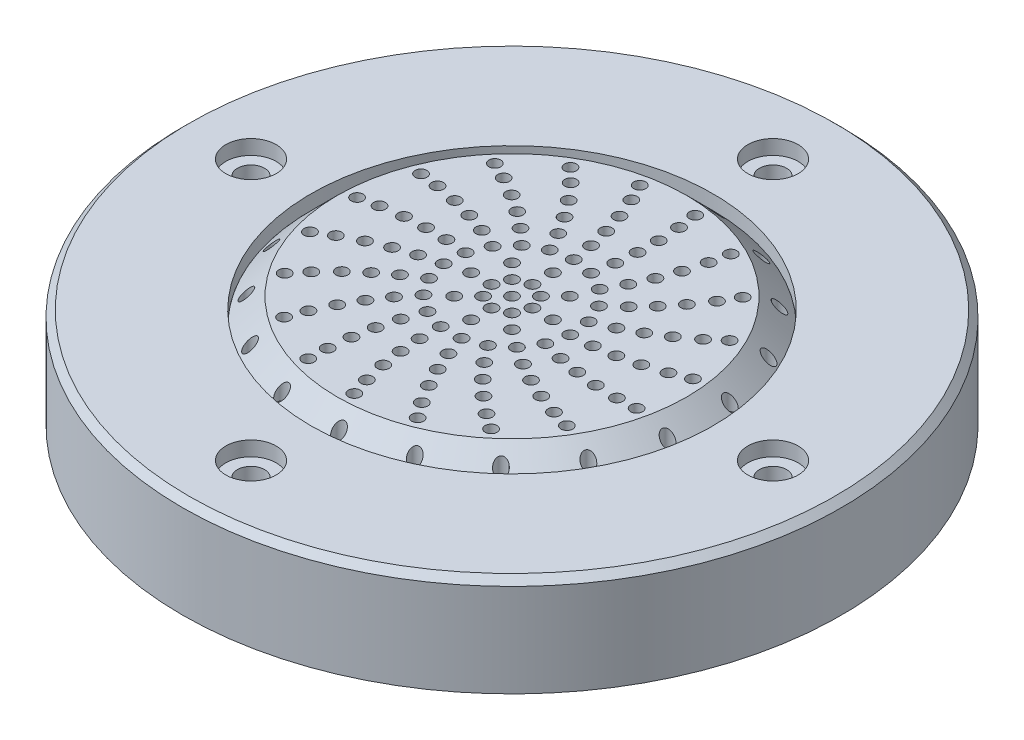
from build123d import *

# Parameters (mm, degrees)
SKETCH2_R           = 19.3675
SKETCH2_R_2         = 2.4257
CUT_EXTRUDE1_DEPTH  = 46.916315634
SKETCH3_R           = 19.3675
BOSS_EXTRUDE1_DEPTH = 2.54
BOSS_EXTRUDE1_DRAFT = -45
SKETCH4_R           = 0.572555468
CUT_EXTRUDE2_DEPTH  = 47.165897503
CIRPATTERN4_COUNT   = 19
SKETCH5_R           = 0.572555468
CUT_EXTRUDE3_DEPTH  = 47.165897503
CIRPATTERN8_COUNT   = 8
SKETCH6_R           = 3.875587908
SKETCH6_R_2         = 1.30500828
BOSS_EXTRUDE2_DEPTH = 2.54


with BuildPart() as part:
    # Sketch1 → Revolve1 (revolve)
    with BuildSketch(Plane.XY, mode=Mode.PRIVATE) as revolve1_sk:
        Polygon((0, 0), (-31.115, 0), (-31.75, -0.635), (-31.75, -9.6012), (-30.3403, -9.6012), (-30.3403, -1.4097), (0, -1.4097), align=None)
    revolve(revolve1_sk.sketch.rotate(Axis((0, -1.4097, 0), (0, -1, 0)), 270), axis=Axis((0, -1.4097, 0), (0, -1, 0)))

    # Sketch2 → Cut-Extrude1 (cut, through all)
    with BuildSketch(Plane(origin=(0, 0, 0), x_dir=(1, 0, 0), z_dir=(0, 1, 0))):
        with Locations(Location((0, 0, 0), (0, 0, 270))):
            Circle(SKETCH2_R)
        with Locations(Location((-25.146, 0, 0), (0, 0, 270))):
            Circle(SKETCH2_R_2)
        with Locations(Location((0, 25.146, 0), (0, 0, 270))):
            Circle(SKETCH2_R_2)
        with Locations(Location((25.146, 0, 0), (0, 0, 270))):
            Circle(SKETCH2_R_2)
        with Locations(Location((0, -25.146, 0), (0, 0, 270))):
            Circle(SKETCH2_R_2)
    extrude(amount=-CUT_EXTRUDE1_DEPTH, mode=Mode.SUBTRACT)

    # Sketch6 → Boss-Extrude2 (add)
    # profile 1 of 4: a face of its own
    with BuildSketch(Plane.XZ.offset(1.4097)):
        with Locations(Location((0, 25.146, 0), (0, 0, 270))):
            Circle(SKETCH6_R)
        with Locations(Location((0, 25.146, 0), (0, 0, 270))):
            Circle(SKETCH6_R_2, mode=Mode.SUBTRACT)
    # profile 2 of 4: a face of its own
    with BuildSketch(Plane.XZ.offset(1.4097)):
        with Locations(Location((25.146, 0, 0), (0, 0, 270))):
            Circle(SKETCH6_R)
        with Locations(Location((25.146, 0, 0), (0, 0, 270))):
            Circle(SKETCH6_R_2, mode=Mode.SUBTRACT)
    # profile 3 of 4: a face of its own
    with BuildSketch(Plane.XZ.offset(1.4097)):
        with Locations(Location((0, -25.146, 0), (0, 0, 270))):
            Circle(SKETCH6_R)
        with Locations(Location((0, -25.146, 0), (0, 0, 270))):
            Circle(SKETCH6_R_2, mode=Mode.SUBTRACT)
    # profile 4 of 4: a face of its own
    with BuildSketch(Plane.XZ.offset(1.4097)):
        with Locations(Location((-25.146, 0, 0), (0, 0, 270))):
            Circle(SKETCH6_R)
        with Locations(Location((-25.146, 0, 0), (0, 0, 270))):
            Circle(SKETCH6_R_2, mode=Mode.SUBTRACT)
    extrude(amount=BOSS_EXTRUDE2_DEPTH)


with BuildPart() as body_2:
    # Sketch3 → Boss-Extrude1 (with draft: the straight prism first)
    with BuildSketch(Plane.XZ.offset(1.4097)):
        with Locations(Location((0, 0, 0), (0, 0, 90))):
            Circle(SKETCH3_R)
    extrude(amount=-BOSS_EXTRUDE1_DEPTH)
    # Boss-Extrude1: the draft: its side faces are tilted about the plane it starts from
    boss_extrude1_sides = [body_2.faces().sort_by_distance(p)[0] for p in [
        (0, -0.1397, -19.3675),
    ]]
    draft(boss_extrude1_sides, Plane.XZ.offset(1.4097), BOSS_EXTRUDE1_DRAFT)

    # Sketch4 → Cut-Extrude2 (cut, through all)
    with BuildSketch(Plane(origin=(0, 1.1303, 0), x_dir=(1, 0, 0), z_dir=(0, 1, 0))):
        with Locations(Location((-5.870140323, 1.398799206, 0), (0, 0, 270))):
            Circle(SKETCH4_R)
        with Locations(Location((0, 0, 0), (0, 0, 270))):
            Circle(SKETCH4_R)
        with Locations(Location((-15.699234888, 0.776761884, 0), (0, 0, 270))):
            Circle(SKETCH4_R)
        with Locations(Location((-13.925579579, 1.16200044, 0), (0, 0, 270))):
            Circle(SKETCH4_R)
        with Locations(Location((-9.868307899, 1.585522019, 0), (0, 0, 270))):
            Circle(SKETCH4_R)
        with Locations(Location((-11.862752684, 1.45531954, 0), (0, 0, 270))):
            Circle(SKETCH4_R)
        with Locations(Location((-7.888237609, 1.567823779, 0), (0, 0, 270))):
            Circle(SKETCH4_R)
        with Locations(Location((-18.236069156, 0, 0), (0, 0, 153.834828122))):
            Circle(SKETCH4_R)
    cut_extrude2 = extrude(amount=-CUT_EXTRUDE2_DEPTH, mode=Mode.SUBTRACT)

    # CirPattern4: Cut-Extrude2 ×19 about axis
    cirpattern4_axis = Axis((0, 0, 0), (0, 1, 0))
    for i in range(1, CIRPATTERN4_COUNT):
        add(cut_extrude2.rotate(cirpattern4_axis, i * 360 / CIRPATTERN4_COUNT), mode=Mode.SUBTRACT)

    # Sketch5 → Cut-Extrude3 (cut, through all)
    with BuildSketch(Plane(origin=(0, 1.1303, 0), x_dir=(1, 0, 0), z_dir=(0, 1, 0))):
        with Locations(Location((-3.940414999, 0, 0), (0, 0, 270))):
            Circle(SKETCH5_R)
        with Locations(Location((-1.9702075, 0, 0), (0, 0, 270))):
            Circle(SKETCH5_R)
    cut_extrude3 = extrude(amount=-CUT_EXTRUDE3_DEPTH, mode=Mode.SUBTRACT)

    # CirPattern8: Cut-Extrude3 ×8 about axis
    cirpattern8_axis = Axis((0, 0, 0), (0, 1, 0))
    for i in range(1, CIRPATTERN8_COUNT):
        add(cut_extrude3.rotate(cirpattern8_axis, i * 360 / CIRPATTERN8_COUNT), mode=Mode.SUBTRACT)


solid = Compound([part.part, body_2.part])
